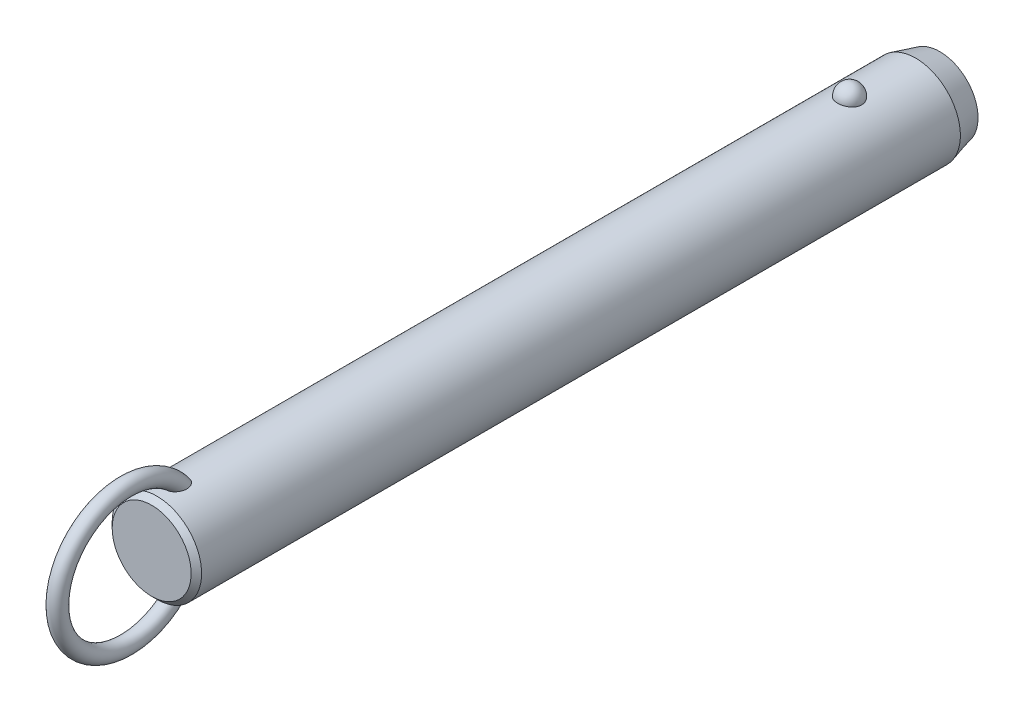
ISO-10303-21;
HEADER;
FILE_DESCRIPTION(('STEP AP214'),'2;1');
FILE_NAME('part.step','',(''),(''),'','','');
FILE_SCHEMA(('AUTOMOTIVE_DESIGN { 1 0 10303 214 1 1 1 1 }'));
ENDSEC;
DATA;
#1=APPLICATION_CONTEXT('core data for automotive mechanical design processes');
#2=APPLICATION_PROTOCOL_DEFINITION('international standard','automotive_design',2000,#1);
#3=PRODUCT_CONTEXT('',#1,'mechanical');
#4=PRODUCT('Part','Part','',(#3));
#5=PRODUCT_RELATED_PRODUCT_CATEGORY('part','',(#4));
#6=PRODUCT_DEFINITION_FORMATION('','',#4);
#7=PRODUCT_DEFINITION_CONTEXT('part definition',#1,'design');
#8=PRODUCT_DEFINITION('design','',#6,#7);
#9=PRODUCT_DEFINITION_SHAPE('','',#8);
#10=(LENGTH_UNIT() NAMED_UNIT(*) SI_UNIT(.MILLI.,.METRE.));
#11=(NAMED_UNIT(*) PLANE_ANGLE_UNIT() SI_UNIT($,.RADIAN.));
#12=(NAMED_UNIT(*) SI_UNIT($,.STERADIAN.) SOLID_ANGLE_UNIT());
#13=UNCERTAINTY_MEASURE_WITH_UNIT(LENGTH_MEASURE(1.E-05),#10,'distance_accuracy_value','');
#14=(GEOMETRIC_REPRESENTATION_CONTEXT(3) GLOBAL_UNCERTAINTY_ASSIGNED_CONTEXT((#13)) GLOBAL_UNIT_ASSIGNED_CONTEXT((#10,
#11,#12)) REPRESENTATION_CONTEXT('',''));
#15=CARTESIAN_POINT('',(0.,0.,0.));
#16=DIRECTION('',(0.,0.,1.));
#17=DIRECTION('',(1.,0.,0.));
#18=AXIS2_PLACEMENT_3D('',#15,#16,#17);
#19=CARTESIAN_POINT('',(0.,0.,157.5));
#20=DIRECTION('',(0.,0.,-1.));
#21=DIRECTION('',(-1.,0.,0.));
#22=AXIS2_PLACEMENT_3D('',#19,#20,#21);
#23=CYLINDRICAL_SURFACE('',#22,11.1);
#24=CARTESIAN_POINT('',(2.9724815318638,10.6945945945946,-3.00000000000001));
#25=CARTESIAN_POINT('',(2.97247830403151,10.6945972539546,-2.8322505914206));
#26=CARTESIAN_POINT('',(2.95876598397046,10.6984356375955,-2.66445972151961));
#27=CARTESIAN_POINT('',(2.90424529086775,10.7133624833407,-2.3336238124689));
#28=CARTESIAN_POINT('',(2.8634252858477,10.7244540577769,-2.17058084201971));
#29=CARTESIAN_POINT('',(2.75573657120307,10.7526272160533,-1.85396767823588));
#30=CARTESIAN_POINT('',(2.68887937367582,10.7697061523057,-1.70039333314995));
#31=CARTESIAN_POINT('',(2.53079696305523,10.8079438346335,-1.4069159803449));
#32=CARTESIAN_POINT('',(2.43957264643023,10.8291024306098,-1.26701246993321));
#33=CARTESIAN_POINT('',(2.23458150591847,10.8732541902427,-1.00409565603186));
#34=CARTESIAN_POINT('',(2.12071295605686,10.8962553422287,-0.881162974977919));
#35=CARTESIAN_POINT('',(1.87365402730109,10.9414421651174,-0.656352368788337));
#36=CARTESIAN_POINT('',(1.74046358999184,10.9636278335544,-0.554474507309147));
#37=CARTESIAN_POINT('',(1.45872188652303,11.0046495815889,-0.374872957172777));
#38=CARTESIAN_POINT('',(1.31021276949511,11.0234944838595,-0.297085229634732));
#39=CARTESIAN_POINT('',(1.00170030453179,11.0557957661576,-0.167529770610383));
#40=CARTESIAN_POINT('',(0.841698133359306,11.0692526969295,-0.1157593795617));
#41=CARTESIAN_POINT('',(0.517607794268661,11.0890932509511,-0.0403925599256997));
#42=CARTESIAN_POINT('',(0.353633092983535,11.0955916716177,-0.0163383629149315));
#43=CARTESIAN_POINT('',(0.0238420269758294,11.1011989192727,0.00445177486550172));
#44=CARTESIAN_POINT('',(-0.141974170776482,11.1003084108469,0.00119017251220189));
#45=CARTESIAN_POINT('',(-0.468405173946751,11.0912990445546,-0.0323233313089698));
#46=CARTESIAN_POINT('',(-0.629059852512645,11.0832767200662,-0.062214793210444));
#47=CARTESIAN_POINT('',(-0.942937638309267,11.0609962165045,-0.147645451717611));
#48=CARTESIAN_POINT('',(-1.09616062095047,11.0467379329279,-0.203185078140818));
#49=CARTESIAN_POINT('',(-1.39181061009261,11.0134071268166,-0.338752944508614));
#50=CARTESIAN_POINT('',(-1.53417383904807,10.9943086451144,-0.418913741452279));
#51=CARTESIAN_POINT('',(-1.80342160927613,10.9533667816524,-0.601448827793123));
#52=CARTESIAN_POINT('',(-1.9303046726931,10.9315231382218,-0.703825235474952));
#53=CARTESIAN_POINT('',(-2.16747598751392,10.887005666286,-0.930091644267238));
#54=CARTESIAN_POINT('',(-2.27742774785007,10.8643239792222,-1.05433291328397));
#55=CARTESIAN_POINT('',(-2.47517316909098,10.8209886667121,-1.31966633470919));
#56=CARTESIAN_POINT('',(-2.56296538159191,10.8003351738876,-1.46075958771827));
#57=CARTESIAN_POINT('',(-2.71500300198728,10.7631304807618,-1.75753646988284));
#58=CARTESIAN_POINT('',(-2.77898901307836,10.7466250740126,-1.91335887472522));
#59=CARTESIAN_POINT('',(-2.88046189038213,10.7198747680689,-2.23391529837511));
#60=CARTESIAN_POINT('',(-2.91794947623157,10.709629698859,-2.3986490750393));
#61=CARTESIAN_POINT('',(-2.96537819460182,10.6965949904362,-2.73165170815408));
#62=CARTESIAN_POINT('',(-2.97542891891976,10.693775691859,-2.89990378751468));
#63=CARTESIAN_POINT('',(-2.96804271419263,10.6958279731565,-3.23575286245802));
#64=CARTESIAN_POINT('',(-2.95060646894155,10.7006993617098,-3.4033498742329));
#65=CARTESIAN_POINT('',(-2.88883358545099,10.71753912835,-3.73233906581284));
#66=CARTESIAN_POINT('',(-2.84462026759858,10.7294749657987,-3.89375610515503));
#67=CARTESIAN_POINT('',(-2.73050447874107,10.7590797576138,-4.20667949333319));
#68=CARTESIAN_POINT('',(-2.66060103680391,10.7767489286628,-4.35818546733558));
#69=CARTESIAN_POINT('',(-2.49642559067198,10.8159599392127,-4.64785421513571));
#70=CARTESIAN_POINT('',(-2.40203047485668,10.8375211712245,-4.78594458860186));
#71=CARTESIAN_POINT('',(-2.19143488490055,10.8820570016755,-5.04410382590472));
#72=CARTESIAN_POINT('',(-2.07523364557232,10.9050316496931,-5.16417205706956));
#73=CARTESIAN_POINT('',(-1.82361254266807,10.9499219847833,-5.3833483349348));
#74=CARTESIAN_POINT('',(-1.68812945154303,10.9718338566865,-5.48238464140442));
#75=CARTESIAN_POINT('',(-1.40191298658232,11.0120611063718,-5.65618873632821));
#76=CARTESIAN_POINT('',(-1.25118062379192,11.0303767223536,-5.73095813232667));
#77=CARTESIAN_POINT('',(-0.940570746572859,11.0611653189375,-5.85334725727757));
#78=CARTESIAN_POINT('',(-0.780821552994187,11.0737044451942,-5.90127578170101));
#79=CARTESIAN_POINT('',(-0.455204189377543,11.0918598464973,-5.96992976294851));
#80=CARTESIAN_POINT('',(-0.289336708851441,11.0974768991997,-5.99065827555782));
#81=CARTESIAN_POINT('',(0.0406846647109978,11.1011307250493,-6.00418773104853));
#82=CARTESIAN_POINT('',(0.204817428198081,11.099299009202,-5.9974731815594));
#83=CARTESIAN_POINT('',(0.5295530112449,11.088551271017,-5.95740317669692));
#84=CARTESIAN_POINT('',(0.69015594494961,11.0796354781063,-5.92404858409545));
#85=CARTESIAN_POINT('',(1.0027760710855,11.0557204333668,-5.83180084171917));
#86=CARTESIAN_POINT('',(1.15482001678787,11.0407414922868,-5.7729929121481));
#87=CARTESIAN_POINT('',(1.44678373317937,11.0062913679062,-5.63147366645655));
#88=CARTESIAN_POINT('',(1.58670279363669,10.9868199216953,-5.54876095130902));
#89=CARTESIAN_POINT('',(1.8527023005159,10.9451315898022,-5.36027644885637));
#90=CARTESIAN_POINT('',(1.97855158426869,10.9228788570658,-5.25418644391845));
#91=CARTESIAN_POINT('',(2.21080872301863,10.8782509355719,-5.02251354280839));
#92=CARTESIAN_POINT('',(2.31721312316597,10.8558757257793,-4.89692718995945));
#93=CARTESIAN_POINT('',(2.5094551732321,10.8130715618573,-4.62745408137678));
#94=CARTESIAN_POINT('',(2.59493284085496,10.7926798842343,-4.48330448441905));
#95=CARTESIAN_POINT('',(2.740862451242,10.7565495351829,-4.18236358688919));
#96=CARTESIAN_POINT('',(2.80132490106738,10.7408089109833,-4.02557762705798));
#97=CARTESIAN_POINT('',(2.88959070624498,10.7173718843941,-3.72475308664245));
#98=CARTESIAN_POINT('',(2.92062102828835,10.7088950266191,-3.58171216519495));
#99=CARTESIAN_POINT('',(2.96206765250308,10.6975052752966,-3.29245795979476));
#100=CARTESIAN_POINT('',(2.97248434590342,10.6945922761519,-3.14624473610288));
#101=CARTESIAN_POINT('',(2.9724815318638,10.6945945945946,-3.00000000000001));
#102=B_SPLINE_CURVE_WITH_KNOTS('',3,(#24,#25,#26,#27,#28,#29,#30,#31,#32,#33,#34,#35,#36,#37,
#38,#39,#40,#41,#42,#43,#44,#45,#46,#47,#48,#49,#50,#51,#52,#53,#54,#55,#56,#57,#58,#59,#60,#61,
#62,#63,#64,#65,#66,#67,#68,#69,#70,#71,#72,#73,#74,#75,#76,#77,#78,#79,#80,#81,#82,#83,#84,#85,
#86,#87,#88,#89,#90,#91,#92,#93,#94,#95,#96,#97,#98,#99,#100,#101),.UNSPECIFIED.,.T.,.F.,(4,2,2,
2,2,2,2,2,2,2,2,2,2,2,2,2,2,2,2,2,2,2,2,2,2,2,2,2,2,2,2,2,2,2,2,2,2,2,4),(0.,0.502722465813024,
1.00566079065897,1.5083769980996,2.01107471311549,2.51608392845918,3.02109467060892,
3.52475118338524,4.02835620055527,4.523518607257,5.0186364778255,5.50715297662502,
5.9956776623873,6.48688002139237,6.97812923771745,7.47814366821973,7.9781907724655,
8.48353712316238,8.9888697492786,9.49218093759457,9.99547960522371,10.4964777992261,
10.997494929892,11.5010810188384,12.0046847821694,12.5099796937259,13.0152411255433,
13.5145635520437,14.0138298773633,14.5043200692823,14.9947943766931,15.4836390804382,
15.9725123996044,16.4685040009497,16.9645836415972,17.4686765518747,17.972557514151,
18.410841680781,18.849117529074),.UNSPECIFIED.);
#103=CARTESIAN_POINT('',(2.9724815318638,10.6945945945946,-3.00000000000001));
#104=VERTEX_POINT('',#103);
#105=EDGE_CURVE('E41',#104,#104,#102,.T.);
#106=ORIENTED_EDGE('',*,*,#105,.T.);
#107=EDGE_LOOP('',(#106));
#108=FACE_BOUND('',#107,.T.);
#109=CARTESIAN_POINT('',(0.,0.,168.9));
#110=DIRECTION('',(0.,0.,1.));
#111=DIRECTION('',(1.,0.,0.));
#112=AXIS2_PLACEMENT_3D('',#109,#110,#111);
#113=CIRCLE('',#112,11.1);
#114=CARTESIAN_POINT('',(-11.1,0.,168.9));
#115=VERTEX_POINT('',#114);
#116=EDGE_CURVE('E10',#115,#115,#113,.F.);
#117=ORIENTED_EDGE('',*,*,#116,.T.);
#118=EDGE_LOOP('',(#117));
#119=FACE_BOUND('',#118,.T.);
#120=CARTESIAN_POINT('',(-0.564520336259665,-11.0856356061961,161.157815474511));
#121=CARTESIAN_POINT('',(-0.667202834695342,-11.0804062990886,161.191283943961));
#122=CARTESIAN_POINT('',(-0.766875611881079,-11.0738877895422,161.233835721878));
#123=CARTESIAN_POINT('',(-0.957284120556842,-11.0590576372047,161.335419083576));
#124=CARTESIAN_POINT('',(-1.04801616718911,-11.0507452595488,161.39445742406));
#125=CARTESIAN_POINT('',(-1.21800952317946,-11.0333016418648,161.526529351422));
#126=CARTESIAN_POINT('',(-1.29730805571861,-11.0241732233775,161.599515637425));
#127=CARTESIAN_POINT('',(-1.44337665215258,-11.0060026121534,161.757037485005));
#128=CARTESIAN_POINT('',(-1.51014622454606,-10.9969604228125,161.841573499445));
#129=CARTESIAN_POINT('',(-1.63454620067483,-10.9791841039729,162.025521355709));
#130=CARTESIAN_POINT('',(-1.69127003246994,-10.9705107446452,162.125549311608));
#131=CARTESIAN_POINT('',(-1.7898078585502,-10.9548648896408,162.332790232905));
#132=CARTESIAN_POINT('',(-1.83161214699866,-10.9478935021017,162.440007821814));
#133=CARTESIAN_POINT('',(-1.91557028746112,-10.9335803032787,162.705408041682));
#134=CARTESIAN_POINT('',(-1.95040620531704,-10.9273269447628,162.865980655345));
#135=CARTESIAN_POINT('',(-1.99388326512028,-10.9194709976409,163.190697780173));
#136=CARTESIAN_POINT('',(-2.00248051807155,-10.9178762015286,163.354847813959));
#137=CARTESIAN_POINT('',(-1.99551615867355,-10.9191578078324,163.724650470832));
#138=CARTESIAN_POINT('',(-1.97322066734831,-10.9232807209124,163.930191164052));
#139=CARTESIAN_POINT('',(-1.91529761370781,-10.9335244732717,164.233595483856));
#140=CARTESIAN_POINT('',(-1.89184575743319,-10.9376266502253,164.334088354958));
#141=CARTESIAN_POINT('',(-1.83700674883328,-10.9469720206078,164.532855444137));
#142=CARTESIAN_POINT('',(-1.80562070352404,-10.9522150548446,164.631129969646));
#143=CARTESIAN_POINT('',(-1.73463055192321,-10.9636837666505,164.825914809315));
#144=CARTESIAN_POINT('',(-1.69493416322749,-10.9699202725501,164.922390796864));
#145=CARTESIAN_POINT('',(-1.60745141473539,-10.9830806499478,165.111626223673));
#146=CARTESIAN_POINT('',(-1.55966150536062,-10.9900048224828,165.204384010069));
#147=CARTESIAN_POINT('',(-1.45591812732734,-11.0042280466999,165.384690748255));
#148=CARTESIAN_POINT('',(-1.40000013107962,-11.0115253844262,165.472260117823));
#149=CARTESIAN_POINT('',(-1.27937470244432,-11.0261911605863,165.641029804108));
#150=CARTESIAN_POINT('',(-1.21467835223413,-11.0335594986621,165.72223795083));
#151=CARTESIAN_POINT('',(-1.08218150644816,-11.0473027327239,165.869001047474));
#152=CARTESIAN_POINT('',(-1.01522633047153,-11.0537063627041,165.935309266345));
#153=CARTESIAN_POINT('',(-0.872952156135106,-11.065850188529,166.058378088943));
#154=CARTESIAN_POINT('',(-0.797642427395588,-11.0715911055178,166.115149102));
#155=CARTESIAN_POINT('',(-0.651396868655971,-11.081071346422,166.207515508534));
#156=CARTESIAN_POINT('',(-0.581712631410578,-11.0849841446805,166.245049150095));
#157=CARTESIAN_POINT('',(-0.437066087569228,-11.0916271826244,166.308259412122));
#158=CARTESIAN_POINT('',(-0.362109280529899,-11.0943586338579,166.333948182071));
#159=CARTESIAN_POINT('',(-0.207828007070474,-11.0983242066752,166.371117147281));
#160=CARTESIAN_POINT('',(-0.12846771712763,-11.0995432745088,166.382454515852));
#161=CARTESIAN_POINT('',(0.0309101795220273,-11.1002423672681,166.388965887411));
#162=CARTESIAN_POINT('',(0.110927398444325,-11.0997233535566,166.384148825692));
#163=CARTESIAN_POINT('',(0.25640659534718,-11.097240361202,166.360959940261));
#164=CARTESIAN_POINT('',(0.322235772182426,-11.0955074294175,166.344754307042));
#165=CARTESIAN_POINT('',(0.450635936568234,-11.0910350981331,166.302600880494));
#166=CARTESIAN_POINT('',(0.513205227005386,-11.0882951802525,166.276648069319));
#167=CARTESIAN_POINT('',(0.662626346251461,-11.0805620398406,166.202607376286));
#168=CARTESIAN_POINT('',(0.747127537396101,-11.0751144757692,166.149845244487));
#169=CARTESIAN_POINT('',(0.906756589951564,-11.0631932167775,166.031720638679));
#170=CARTESIAN_POINT('',(0.981859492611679,-11.0567168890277,165.966325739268));
#171=CARTESIAN_POINT('',(1.10712207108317,-11.0447856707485,165.84226337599));
#172=CARTESIAN_POINT('',(1.15909566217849,-11.0394280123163,165.785383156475));
#173=CARTESIAN_POINT('',(1.25791923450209,-11.0286040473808,165.667327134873));
#174=CARTESIAN_POINT('',(1.30476642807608,-11.0231376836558,165.606149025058));
#175=CARTESIAN_POINT('',(1.43818612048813,-11.0068027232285,165.417305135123));
#176=CARTESIAN_POINT('',(1.51751767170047,-10.9960104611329,165.284453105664));
#177=CARTESIAN_POINT('',(1.63597546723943,-10.9788847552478,165.053137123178));
#178=CARTESIAN_POINT('',(1.67988876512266,-10.9722190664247,164.957053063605));
#179=CARTESIAN_POINT('',(1.75953241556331,-10.9597298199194,164.761431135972));
#180=CARTESIAN_POINT('',(1.79525967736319,-10.9539065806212,164.661891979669));
#181=CARTESIAN_POINT('',(1.85844731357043,-10.9433632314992,164.46021118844));
#182=CARTESIAN_POINT('',(1.8859107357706,-10.9386427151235,164.35807052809));
#183=CARTESIAN_POINT('',(1.93234324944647,-10.9305350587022,164.151819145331));
#184=CARTESIAN_POINT('',(1.95131065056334,-10.9271481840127,164.047708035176));
#185=CARTESIAN_POINT('',(1.99040203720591,-10.9201183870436,163.765458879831));
#186=CARTESIAN_POINT('',(2.00221217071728,-10.9179256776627,163.586037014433));
#187=CARTESIAN_POINT('',(1.99711676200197,-10.9188636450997,163.227713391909));
#188=CARTESIAN_POINT('',(1.98026150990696,-10.9219849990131,163.048811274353));
#189=CARTESIAN_POINT('',(1.92151657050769,-10.9324473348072,162.73645144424));
#190=CARTESIAN_POINT('',(1.88605081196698,-10.9386915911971,162.601759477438));
#191=CARTESIAN_POINT('',(1.79393020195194,-10.9541780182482,162.339966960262));
#192=CARTESIAN_POINT('',(1.73729868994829,-10.9634168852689,162.212858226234));
#193=CARTESIAN_POINT('',(1.61237037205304,-10.9824218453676,161.989418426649));
#194=CARTESIAN_POINT('',(1.54715374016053,-10.9918945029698,161.891345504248));
#195=CARTESIAN_POINT('',(1.40127026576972,-11.0114415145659,161.707434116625));
#196=CARTESIAN_POINT('',(1.3206074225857,-11.0215157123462,161.621592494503));
#197=CARTESIAN_POINT('',(1.1447478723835,-11.041168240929,161.465163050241));
#198=CARTESIAN_POINT('',(1.04947805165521,-11.0507437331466,161.394656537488));
#199=CARTESIAN_POINT('',(0.84727806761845,-11.0680789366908,161.272640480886));
#200=CARTESIAN_POINT('',(0.740351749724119,-11.0758392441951,161.221124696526));
#201=CARTESIAN_POINT('',(0.529289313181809,-11.0878275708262,161.143485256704));
#202=CARTESIAN_POINT('',(0.425895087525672,-11.0923259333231,161.115377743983));
#203=CARTESIAN_POINT('',(0.215723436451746,-11.0984001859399,161.077703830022));
#204=CARTESIAN_POINT('',(0.10894793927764,-11.0999777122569,161.068127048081));
#205=CARTESIAN_POINT('',(-0.0938962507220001,-11.1000196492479,161.067877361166));
#206=CARTESIAN_POINT('',(-0.189967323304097,-11.0987797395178,161.075408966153));
#207=CARTESIAN_POINT('',(-0.379657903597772,-11.0939111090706,161.105507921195));
#208=CARTESIAN_POINT('',(-0.473277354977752,-11.0902823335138,161.128075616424));
#209=CARTESIAN_POINT('',(-0.564520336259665,-11.0856356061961,161.157815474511));
#210=B_SPLINE_CURVE_WITH_KNOTS('',3,(#120,#121,#122,#123,#124,#125,#126,#127,#128,#129,#130,
#131,#132,#133,#134,#135,#136,#137,#138,#139,#140,#141,#142,#143,#144,#145,#146,#147,#148,#149,
#150,#151,#152,#153,#154,#155,#156,#157,#158,#159,#160,#161,#162,#163,#164,#165,#166,#167,#168,
#169,#170,#171,#172,#173,#174,#175,#176,#177,#178,#179,#180,#181,#182,#183,#184,#185,#186,#187,
#188,#189,#190,#191,#192,#193,#194,#195,#196,#197,#198,#199,#200,#201,#202,#203,#204,#205,#206,
#207,#208,#209),.UNSPECIFIED.,.T.,.F.,(4,2,2,2,2,2,2,2,2,2,2,2,2,2,2,2,2,2,2,2,2,2,2,2,2,2,2,2,
2,2,2,2,2,2,2,2,2,2,2,2,2,2,2,2,4),(0.,0.323999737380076,0.648132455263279,0.971184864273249,
1.29424994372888,1.63886237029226,1.98369857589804,2.47426059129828,2.96564271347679,
3.58257396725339,3.89215258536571,4.20168803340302,4.51486273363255,4.82817514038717,
5.14015911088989,5.45175282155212,5.73442856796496,6.01679375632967,6.25364580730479,
6.49025437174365,6.72919963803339,6.96801276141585,7.17061258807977,7.37331685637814,
7.67094989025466,7.96935728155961,8.20075067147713,8.43226927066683,8.89581623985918,
9.21306533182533,9.5304340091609,9.84768549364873,10.1650000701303,10.7022930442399,
11.2386443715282,11.655339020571,12.071575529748,12.4245637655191,12.7774607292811,
13.1321855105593,13.4867936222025,13.8068771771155,14.1267813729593,14.4146787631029,
14.7025827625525),.UNSPECIFIED.);
#211=CARTESIAN_POINT('',(-0.564520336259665,-11.0856356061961,161.157815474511));
#212=VERTEX_POINT('',#211);
#213=EDGE_CURVE('E60',#212,#212,#210,.T.);
#214=ORIENTED_EDGE('',*,*,#213,.T.);
#215=EDGE_LOOP('',(#214));
#216=FACE_BOUND('',#215,.T.);
#217=CARTESIAN_POINT('',(-0.564520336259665,11.0856356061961,161.157815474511));
#218=CARTESIAN_POINT('',(-0.468542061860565,11.0905203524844,161.126545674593));
#219=CARTESIAN_POINT('',(-0.369793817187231,11.0942886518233,161.103157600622));
#220=CARTESIAN_POINT('',(-0.169555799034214,11.0991586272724,161.073085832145));
#221=CARTESIAN_POINT('',(-0.0680604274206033,11.1002543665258,161.06643932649));
#222=CARTESIAN_POINT('',(0.13454973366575,11.099646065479,161.070157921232));
#223=CARTESIAN_POINT('',(0.235664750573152,11.0979441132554,161.08051033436));
#224=CARTESIAN_POINT('',(0.434632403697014,11.0919342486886,161.117831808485));
#225=CARTESIAN_POINT('',(0.532486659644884,11.0876276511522,161.144792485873));
#226=CARTESIAN_POINT('',(0.722445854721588,11.0768742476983,161.2144096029));
#227=CARTESIAN_POINT('',(0.814543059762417,11.0704246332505,161.257086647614));
#228=CARTESIAN_POINT('',(0.990565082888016,11.0560659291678,161.356648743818));
#229=CARTESIAN_POINT('',(1.07448844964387,11.048156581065,161.413536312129));
#230=CARTESIAN_POINT('',(1.23562672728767,11.0313221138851,161.542210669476));
#231=CARTESIAN_POINT('',(1.3124268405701,11.0223686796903,161.614511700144));
#232=CARTESIAN_POINT('',(1.45398030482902,11.0045918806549,161.770042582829));
#233=CARTESIAN_POINT('',(1.51873073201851,10.9957685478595,161.853275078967));
#234=CARTESIAN_POINT('',(1.64107232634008,10.9782087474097,162.036384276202));
#235=CARTESIAN_POINT('',(1.6974317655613,10.9695572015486,162.137089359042));
#236=CARTESIAN_POINT('',(1.79515063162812,10.9539887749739,162.345626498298));
#237=CARTESIAN_POINT('',(1.83649966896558,10.9470730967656,162.45346343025));
#238=CARTESIAN_POINT('',(1.91931148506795,10.9329211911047,162.720399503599));
#239=CARTESIAN_POINT('',(1.95340104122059,10.9267904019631,162.881861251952));
#240=CARTESIAN_POINT('',(1.99526195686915,10.9192174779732,163.20821631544));
#241=CARTESIAN_POINT('',(2.00298989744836,10.9177830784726,163.37311484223));
#242=CARTESIAN_POINT('',(1.99396251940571,10.9194420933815,163.744100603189));
#243=CARTESIAN_POINT('',(1.97050829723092,10.923774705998,163.95003871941));
#244=CARTESIAN_POINT('',(1.91079643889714,10.9343131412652,164.253901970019));
#245=CARTESIAN_POINT('',(1.88673702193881,10.9385106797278,164.354529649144));
#246=CARTESIAN_POINT('',(1.8306550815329,10.9480376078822,164.553510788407));
#247=CARTESIAN_POINT('',(1.79863369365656,10.9533668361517,164.651864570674));
#248=CARTESIAN_POINT('',(1.72633365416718,10.9649954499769,164.846720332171));
#249=CARTESIAN_POINT('',(1.68596409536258,10.9713053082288,164.94318790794));
#250=CARTESIAN_POINT('',(1.59707998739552,10.9845964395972,165.132323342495));
#251=CARTESIAN_POINT('',(1.54856169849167,10.9915780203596,165.224989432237));
#252=CARTESIAN_POINT('',(1.44330168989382,11.0058935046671,165.404975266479));
#253=CARTESIAN_POINT('',(1.3865974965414,11.0132257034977,165.492316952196));
#254=CARTESIAN_POINT('',(1.2643115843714,11.0279330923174,165.660456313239));
#255=CARTESIAN_POINT('',(1.19874160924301,11.0353082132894,165.741262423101));
#256=CARTESIAN_POINT('',(1.06542088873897,11.048931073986,165.885985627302));
#257=CARTESIAN_POINT('',(0.998640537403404,11.0552153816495,165.950784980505));
#258=CARTESIAN_POINT('',(0.856896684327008,11.0671032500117,166.070846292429));
#259=CARTESIAN_POINT('',(0.781942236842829,11.0727075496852,166.126118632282));
#260=CARTESIAN_POINT('',(0.636276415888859,11.081949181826,166.215972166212));
#261=CARTESIAN_POINT('',(0.566755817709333,11.0857572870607,166.252441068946));
#262=CARTESIAN_POINT('',(0.422602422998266,11.0921860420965,166.313533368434));
#263=CARTESIAN_POINT('',(0.347974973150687,11.0948079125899,166.338168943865));
#264=CARTESIAN_POINT('',(0.194593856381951,11.0985608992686,166.373323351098));
#265=CARTESIAN_POINT('',(0.115807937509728,11.0996777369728,166.383706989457));
#266=CARTESIAN_POINT('',(-0.0422499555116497,11.1002003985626,166.388574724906));
#267=CARTESIAN_POINT('',(-0.121521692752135,11.09960699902,166.383066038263));
#268=CARTESIAN_POINT('',(-0.266046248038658,11.0970123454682,166.358827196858));
#269=CARTESIAN_POINT('',(-0.331661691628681,11.0952283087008,166.342135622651));
#270=CARTESIAN_POINT('',(-0.459588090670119,11.0906663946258,166.299111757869));
#271=CARTESIAN_POINT('',(-0.52189737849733,11.0878880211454,166.272774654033));
#272=CARTESIAN_POINT('',(-0.671446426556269,11.0800342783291,166.197513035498));
#273=CARTESIAN_POINT('',(-0.756250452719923,11.0744969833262,166.143818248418));
#274=CARTESIAN_POINT('',(-0.916349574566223,11.0624045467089,166.023802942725));
#275=CARTESIAN_POINT('',(-0.991618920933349,11.0558467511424,165.957449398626));
#276=CARTESIAN_POINT('',(-1.11713140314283,11.0437783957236,165.831633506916));
#277=CARTESIAN_POINT('',(-1.16920539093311,11.0383619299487,165.773952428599));
#278=CARTESIAN_POINT('',(-1.26817476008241,11.02743010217,165.654280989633));
#279=CARTESIAN_POINT('',(-1.31506731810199,11.0219146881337,165.592288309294));
#280=CARTESIAN_POINT('',(-1.40399813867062,11.0109399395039,165.464784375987));
#281=CARTESIAN_POINT('',(-1.44602864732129,11.0054807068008,165.399267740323));
#282=CARTESIAN_POINT('',(-1.52538779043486,10.9947621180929,165.265422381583));
#283=CARTESIAN_POINT('',(-1.56271516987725,10.9895028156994,165.197092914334));
#284=CARTESIAN_POINT('',(-1.64537943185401,10.9774790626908,165.033210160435));
#285=CARTESIAN_POINT('',(-1.68879497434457,10.9708503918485,164.9366735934));
#286=CARTESIAN_POINT('',(-1.76740738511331,10.9584602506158,164.740236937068));
#287=CARTESIAN_POINT('',(-1.80260120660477,10.95269910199,164.64033561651));
#288=CARTESIAN_POINT('',(-1.86468657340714,10.9423003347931,164.437966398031));
#289=CARTESIAN_POINT('',(-1.8915816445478,10.9376622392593,164.335499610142));
#290=CARTESIAN_POINT('',(-1.93682458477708,10.9297405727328,164.128642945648));
#291=CARTESIAN_POINT('',(-1.95517082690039,10.9264572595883,164.024252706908));
#292=CARTESIAN_POINT('',(-1.99232562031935,10.9197647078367,163.74262876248));
#293=CARTESIAN_POINT('',(-2.00294603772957,10.9177914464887,163.564185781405));
#294=CARTESIAN_POINT('',(-1.99566675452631,10.9191290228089,163.207996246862));
#295=CARTESIAN_POINT('',(-1.97781651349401,10.9224306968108,163.03024902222));
#296=CARTESIAN_POINT('',(-1.91747214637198,10.93315926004,162.719792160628));
#297=CARTESIAN_POINT('',(-1.88131022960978,10.9395108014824,162.585825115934));
#298=CARTESIAN_POINT('',(-1.78790380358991,10.9551659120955,162.32559757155));
#299=CARTESIAN_POINT('',(-1.7306830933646,10.9644661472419,162.199328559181));
#300=CARTESIAN_POINT('',(-1.60475573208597,10.9835398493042,161.97741565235));
#301=CARTESIAN_POINT('',(-1.53908879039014,10.9930297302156,161.880026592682));
#302=CARTESIAN_POINT('',(-1.39238608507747,11.0125708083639,161.697525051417));
#303=CARTESIAN_POINT('',(-1.31135150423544,11.0226219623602,161.612411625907));
#304=CARTESIAN_POINT('',(-1.14382035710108,11.0411991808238,161.46529943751));
#305=CARTESIAN_POINT('',(-1.0585850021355,11.0497792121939,161.40186930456));
#306=CARTESIAN_POINT('',(-0.878723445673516,11.0655285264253,161.290250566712));
#307=CARTESIAN_POINT('',(-0.784123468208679,11.0727015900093,161.242020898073));
#308=CARTESIAN_POINT('',(-0.646163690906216,11.0812501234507,161.186023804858));
#309=CARTESIAN_POINT('',(-0.605595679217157,11.0835451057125,161.171197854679));
#310=CARTESIAN_POINT('',(-0.564520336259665,11.0856356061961,161.157815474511));
#311=B_SPLINE_CURVE_WITH_KNOTS('',3,(#217,#218,#219,#220,#221,#222,#223,#224,#225,#226,#227,
#228,#229,#230,#231,#232,#233,#234,#235,#236,#237,#238,#239,#240,#241,#242,#243,#244,#245,#246,
#247,#248,#249,#250,#251,#252,#253,#254,#255,#256,#257,#258,#259,#260,#261,#262,#263,#264,#265,
#266,#267,#268,#269,#270,#271,#272,#273,#274,#275,#276,#277,#278,#279,#280,#281,#282,#283,#284,
#285,#286,#287,#288,#289,#290,#291,#292,#293,#294,#295,#296,#297,#298,#299,#300,#301,#302,#303,
#304,#305,#306,#307,#308,#309,#310),.UNSPECIFIED.,.T.,.F.,(4,2,2,2,2,2,2,2,2,2,2,2,2,2,2,2,2,2,
2,2,2,2,2,2,2,2,2,2,2,2,2,2,2,2,2,2,2,2,2,2,2,2,2,2,2,2,4),(0.,0.303061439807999,
0.606795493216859,0.910302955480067,1.21365733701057,1.51741085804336,1.82121821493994,
2.13745205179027,2.45376252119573,2.79958678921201,3.14564996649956,3.63832391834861,
4.13180893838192,4.75031912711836,5.06071926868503,5.37107516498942,5.68500772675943,
5.99908475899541,6.31176519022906,6.62403542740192,6.90315673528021,7.18197194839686,
7.41687778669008,7.65154134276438,7.88841587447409,8.12518286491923,8.32752842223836,
8.52997509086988,8.82986421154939,9.13054668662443,9.36393502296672,9.59744991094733,
9.83133221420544,10.0652767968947,10.3830324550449,10.7009056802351,11.0186436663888,
11.3364420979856,11.8705925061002,12.4038159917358,12.8189662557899,13.2336487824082,
13.5857049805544,13.9377340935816,14.2561354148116,14.5736690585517,14.7033687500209),.UNSPECIFIED.);
#312=CARTESIAN_POINT('',(-0.564520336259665,11.0856356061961,161.157815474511));
#313=VERTEX_POINT('',#312);
#314=EDGE_CURVE('E68',#313,#313,#311,.T.);
#315=ORIENTED_EDGE('',*,*,#314,.T.);
#316=EDGE_LOOP('',(#315));
#317=FACE_BOUND('',#316,.T.);
#318=CARTESIAN_POINT('',(0.,0.,-19.3999999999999));
#319=DIRECTION('',(0.,0.,-1.));
#320=DIRECTION('',(-1.,0.,0.));
#321=AXIS2_PLACEMENT_3D('',#318,#319,#320);
#322=CIRCLE('',#321,11.1);
#323=CARTESIAN_POINT('',(-11.1,0.,-19.3999999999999));
#324=VERTEX_POINT('',#323);
#325=EDGE_CURVE('E57',#324,#324,#322,.F.);
#326=ORIENTED_EDGE('',*,*,#325,.T.);
#327=EDGE_LOOP('',(#326));
#328=FACE_BOUND('',#327,.T.);
#329=ADVANCED_FACE('F37',(#108,#119,#216,#317,#328),#23,.T.);
#330=CARTESIAN_POINT('',(0.,0.,-25.4));
#331=DIRECTION('',(0.,0.,-1.));
#332=DIRECTION('',(-1.,0.,0.));
#333=AXIS2_PLACEMENT_3D('',#330,#331,#332);
#334=PLANE('',#333);
#335=CARTESIAN_POINT('',(0.,0.,-25.4));
#336=DIRECTION('',(0.,0.,-1.));
#337=DIRECTION('',(-1.,0.,0.));
#338=AXIS2_PLACEMENT_3D('',#335,#336,#337);
#339=CIRCLE('',#338,9.49230484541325);
#340=CARTESIAN_POINT('',(-9.49230484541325,0.,-25.4));
#341=VERTEX_POINT('',#340);
#342=EDGE_CURVE('E67',#341,#341,#339,.T.);
#343=ORIENTED_EDGE('',*,*,#342,.T.);
#344=EDGE_LOOP('',(#343));
#345=FACE_BOUND('',#344,.T.);
#346=ADVANCED_FACE('F86',(#345),#334,.T.);
#347=CARTESIAN_POINT('',(0.,0.,-25.4));
#348=DIRECTION('',(0.,0.,1.));
#349=DIRECTION('',(1.,0.,0.));
#350=AXIS2_PLACEMENT_3D('',#347,#348,#349);
#351=CONICAL_SURFACE('',#350,9.49230484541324,0.261799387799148);
#352=ORIENTED_EDGE('',*,*,#325,.F.);
#353=EDGE_LOOP('',(#352));
#354=FACE_BOUND('',#353,.T.);
#355=ORIENTED_EDGE('',*,*,#342,.F.);
#356=EDGE_LOOP('',(#355));
#357=FACE_BOUND('',#356,.T.);
#358=ADVANCED_FACE('F84',(#354,#357),#351,.T.);
#359=CARTESIAN_POINT('',(0.,0.,170.2));
#360=DIRECTION('',(0.,0.,1.));
#361=DIRECTION('',(1.,0.,0.));
#362=AXIS2_PLACEMENT_3D('',#359,#360,#361);
#363=PLANE('',#362);
#364=CARTESIAN_POINT('',(0.,0.,170.2));
#365=DIRECTION('',(0.,0.,1.));
#366=DIRECTION('',(1.,0.,0.));
#367=AXIS2_PLACEMENT_3D('',#364,#365,#366);
#368=CIRCLE('',#367,9.80000000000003);
#369=CARTESIAN_POINT('',(-9.80000000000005,0.,170.2));
#370=VERTEX_POINT('',#369);
#371=EDGE_CURVE('E50',#370,#370,#368,.T.);
#372=ORIENTED_EDGE('',*,*,#371,.T.);
#373=EDGE_LOOP('',(#372));
#374=FACE_BOUND('',#373,.T.);
#375=ADVANCED_FACE('F78',(#374),#363,.T.);
#376=CARTESIAN_POINT('',(0.,0.,176.55));
#377=DIRECTION('',(1.,0.,0.));
#378=DIRECTION('',(0.,0.,-1.));
#379=AXIS2_PLACEMENT_3D('',#376,#377,#378);
#380=TOROIDAL_SURFACE('',#379,17.05,2.);
#381=ORIENTED_EDGE('',*,*,#314,.F.);
#382=EDGE_LOOP('',(#381));
#383=FACE_BOUND('',#382,.T.);
#384=ORIENTED_EDGE('',*,*,#213,.F.);
#385=EDGE_LOOP('',(#384));
#386=FACE_BOUND('',#385,.T.);
#387=ADVANCED_FACE('F74',(#383,#386),#380,.T.);
#388=CARTESIAN_POINT('',(0.,0.,170.2));
#389=DIRECTION('',(0.,0.,-1.));
#390=DIRECTION('',(-1.,0.,0.));
#391=AXIS2_PLACEMENT_3D('',#388,#389,#390);
#392=CONICAL_SURFACE('',#391,9.80000000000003,0.785398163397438);
#393=CARTESIAN_POINT('',(-11.1,0.,168.9));
#394=CARTESIAN_POINT('',(-11.0864583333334,0.,168.913541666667));
#395=CARTESIAN_POINT('',(-11.0729166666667,0.,168.927083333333));
#396=CARTESIAN_POINT('',(-11.0458333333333,0.,168.954166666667));
#397=CARTESIAN_POINT('',(-11.0322916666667,0.,168.967708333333));
#398=CARTESIAN_POINT('',(-11.0052083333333,0.,168.994791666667));
#399=CARTESIAN_POINT('',(-10.9916666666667,0.,169.008333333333));
#400=CARTESIAN_POINT('',(-10.9645833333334,0.,169.035416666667));
#401=CARTESIAN_POINT('',(-10.9510416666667,0.,169.048958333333));
#402=CARTESIAN_POINT('',(-10.9239583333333,0.,169.076041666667));
#403=CARTESIAN_POINT('',(-10.9104166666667,0.,169.089583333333));
#404=CARTESIAN_POINT('',(-10.8833333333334,0.,169.116666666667));
#405=CARTESIAN_POINT('',(-10.8697916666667,0.,169.130208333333));
#406=CARTESIAN_POINT('',(-10.8427083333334,0.,169.157291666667));
#407=CARTESIAN_POINT('',(-10.8291666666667,0.,169.170833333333));
#408=CARTESIAN_POINT('',(-10.8020833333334,0.,169.197916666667));
#409=CARTESIAN_POINT('',(-10.7885416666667,0.,169.211458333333));
#410=CARTESIAN_POINT('',(-10.7614583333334,0.,169.238541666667));
#411=CARTESIAN_POINT('',(-10.7479166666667,0.,169.252083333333));
#412=CARTESIAN_POINT('',(-10.7208333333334,0.,169.279166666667));
#413=CARTESIAN_POINT('',(-10.7072916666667,0.,169.292708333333));
#414=CARTESIAN_POINT('',(-10.6802083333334,0.,169.319791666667));
#415=CARTESIAN_POINT('',(-10.6666666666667,0.,169.333333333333));
#416=CARTESIAN_POINT('',(-10.6395833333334,0.,169.360416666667));
#417=CARTESIAN_POINT('',(-10.6260416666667,0.,169.373958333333));
#418=CARTESIAN_POINT('',(-10.5989583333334,0.,169.401041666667));
#419=CARTESIAN_POINT('',(-10.5854166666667,0.,169.414583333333));
#420=CARTESIAN_POINT('',(-10.5583333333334,0.,169.441666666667));
#421=CARTESIAN_POINT('',(-10.5447916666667,0.,169.455208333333));
#422=CARTESIAN_POINT('',(-10.5177083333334,0.,169.482291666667));
#423=CARTESIAN_POINT('',(-10.5041666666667,0.,169.495833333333));
#424=CARTESIAN_POINT('',(-10.4770833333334,0.,169.522916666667));
#425=CARTESIAN_POINT('',(-10.4635416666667,0.,169.536458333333));
#426=CARTESIAN_POINT('',(-10.4364583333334,0.,169.563541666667));
#427=CARTESIAN_POINT('',(-10.4229166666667,0.,169.577083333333));
#428=CARTESIAN_POINT('',(-10.3958333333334,0.,169.604166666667));
#429=CARTESIAN_POINT('',(-10.3822916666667,0.,169.617708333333));
#430=CARTESIAN_POINT('',(-10.3552083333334,0.,169.644791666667));
#431=CARTESIAN_POINT('',(-10.3416666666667,0.,169.658333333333));
#432=CARTESIAN_POINT('',(-10.3145833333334,0.,169.685416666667));
#433=CARTESIAN_POINT('',(-10.3010416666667,0.,169.698958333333));
#434=CARTESIAN_POINT('',(-10.2739583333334,0.,169.726041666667));
#435=CARTESIAN_POINT('',(-10.2604166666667,0.,169.739583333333));
#436=CARTESIAN_POINT('',(-10.2333333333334,0.,169.766666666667));
#437=CARTESIAN_POINT('',(-10.2197916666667,0.,169.780208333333));
#438=CARTESIAN_POINT('',(-10.1927083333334,0.,169.807291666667));
#439=CARTESIAN_POINT('',(-10.1791666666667,0.,169.820833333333));
#440=CARTESIAN_POINT('',(-10.1520833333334,0.,169.847916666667));
#441=CARTESIAN_POINT('',(-10.1385416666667,0.,169.861458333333));
#442=CARTESIAN_POINT('',(-10.1114583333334,0.,169.888541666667));
#443=CARTESIAN_POINT('',(-10.0979166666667,0.,169.902083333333));
#444=CARTESIAN_POINT('',(-10.0708333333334,0.,169.929166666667));
#445=CARTESIAN_POINT('',(-10.0572916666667,0.,169.942708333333));
#446=CARTESIAN_POINT('',(-10.0302083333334,0.,169.969791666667));
#447=CARTESIAN_POINT('',(-10.0166666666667,0.,169.983333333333));
#448=CARTESIAN_POINT('',(-9.98958333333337,0.,170.010416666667));
#449=CARTESIAN_POINT('',(-9.97604166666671,0.,170.023958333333));
#450=CARTESIAN_POINT('',(-9.94895833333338,0.,170.051041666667));
#451=CARTESIAN_POINT('',(-9.93541666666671,0.,170.064583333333));
#452=CARTESIAN_POINT('',(-9.90833333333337,0.,170.091666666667));
#453=CARTESIAN_POINT('',(-9.89479166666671,0.,170.105208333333));
#454=CARTESIAN_POINT('',(-9.86770833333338,0.,170.132291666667));
#455=CARTESIAN_POINT('',(-9.85416666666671,0.,170.145833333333));
#456=CARTESIAN_POINT('',(-9.82708333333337,0.,170.172916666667));
#457=CARTESIAN_POINT('',(-9.8135416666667,0.,170.186458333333));
#458=CARTESIAN_POINT('',(-9.80000000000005,0.,170.2));
#459=B_SPLINE_CURVE_WITH_KNOTS('',3,(#393,#394,#395,#396,#397,#398,#399,#400,#401,#402,#403,
#404,#405,#406,#407,#408,#409,#410,#411,#412,#413,#414,#415,#416,#417,#418,#419,#420,#421,#422,
#423,#424,#425,#426,#427,#428,#429,#430,#431,#432,#433,#434,#435,#436,#437,#438,#439,#440,#441,
#442,#443,#444,#445,#446,#447,#448,#449,#450,#451,#452,#453,#454,#455,#456,#457,#458),
.UNSPECIFIED.,.F.,.F.,(4,2,2,2,2,2,2,2,2,2,2,2,2,2,2,2,2,2,2,2,2,2,2,2,2,2,2,2,2,2,2,2,4),(0.,
0.0574524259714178,0.114904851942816,0.172357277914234,0.229809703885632,0.28726212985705,
0.344714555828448,0.402166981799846,0.459619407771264,0.517071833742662,0.57452425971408,
0.631976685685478,0.689429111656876,0.746881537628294,0.804333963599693,0.86178638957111,
0.919238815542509,0.976691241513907,1.03414366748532,1.09159609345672,1.14904851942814,
1.20650094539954,1.26395337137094,1.32140579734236,1.37885822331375,1.43631064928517,
1.49376307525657,1.55121550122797,1.60866792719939,1.66612035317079,1.7235727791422,
1.7810252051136,1.83847763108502),.UNSPECIFIED.);
#460=EDGE_CURVE('BSEAM39',#115,#370,#459,.T.);
#461=ORIENTED_EDGE('',*,*,#116,.F.);
#462=ORIENTED_EDGE('',*,*,#371,.F.);
#463=ORIENTED_EDGE('',*,*,#460,.T.);
#464=ORIENTED_EDGE('',*,*,#460,.F.);
#465=EDGE_LOOP('',(#461,#463,#462,#464));
#466=FACE_BOUND('',#465,.T.);
#467=ADVANCED_FACE('F39',(#466),#392,.T.);
#468=CARTESIAN_POINT('',(0.,11.1,-3.00000000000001));
#469=DIRECTION('',(0.,1.,0.));
#470=DIRECTION('',(0.,0.,-1.));
#471=AXIS2_PLACEMENT_3D('',#468,#469,#470);
#472=SPHERICAL_SURFACE('',#471,3.);
#473=ORIENTED_EDGE('',*,*,#105,.F.);
#474=EDGE_LOOP('',(#473));
#475=FACE_BOUND('',#474,.T.);
#476=ADVANCED_FACE('F80',(#475),#472,.T.);
#477=CLOSED_SHELL('',(#329,#346,#358,#375,#387,#467,#476));
#478=MANIFOLD_SOLID_BREP('B2',#477);
#479=ADVANCED_BREP_SHAPE_REPRESENTATION('',(#18,#478),#14);
#480=SHAPE_DEFINITION_REPRESENTATION(#9,#479);
ENDSEC;
END-ISO-10303-21;
